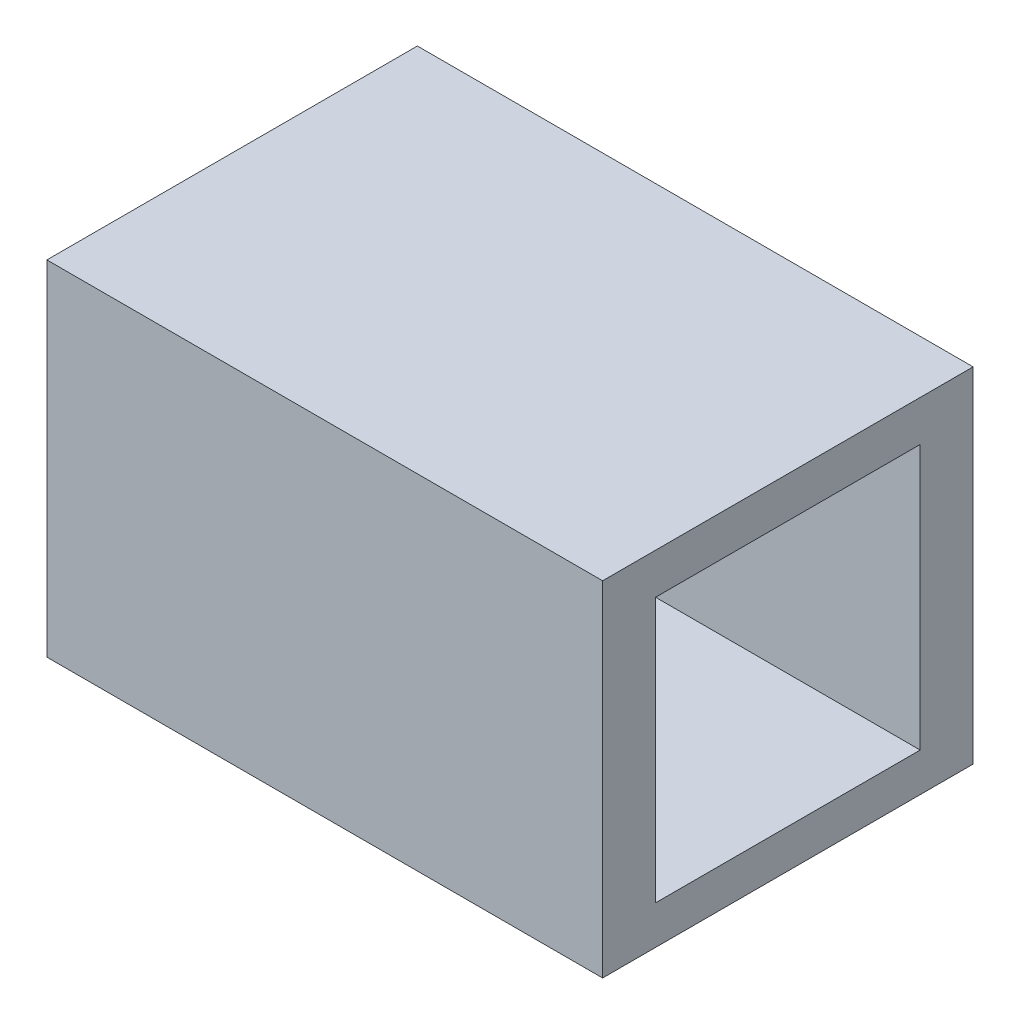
from build123d import *

# Parameters (mm, degrees)
SKETCH2_W           = 21
SKETCH2_H           = 13
BOSS_EXTRUDE1_DEPTH = 14
SKETCH3_W           = 10
SKETCH3_H           = 10
CUT_EXTRUDE1_DEPTH  = 17


with BuildPart() as part:
    # Sketch2 → Boss-Extrude1 (new body)
    with BuildSketch(Plane.XY):
        Rectangle(SKETCH2_W, SKETCH2_H)
    extrude(amount=BOSS_EXTRUDE1_DEPTH)

    # Sketch3 → Cut-Extrude1 (cut)
    with BuildSketch(Plane(origin=(10.5, 0, 0), x_dir=(0, 0, -1), z_dir=(1, 0, 0))):
        with Locations((-7, -0.040043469)):
            Rectangle(SKETCH3_W, SKETCH3_H)
    extrude(amount=-CUT_EXTRUDE1_DEPTH, mode=Mode.SUBTRACT)


solid = part.part
